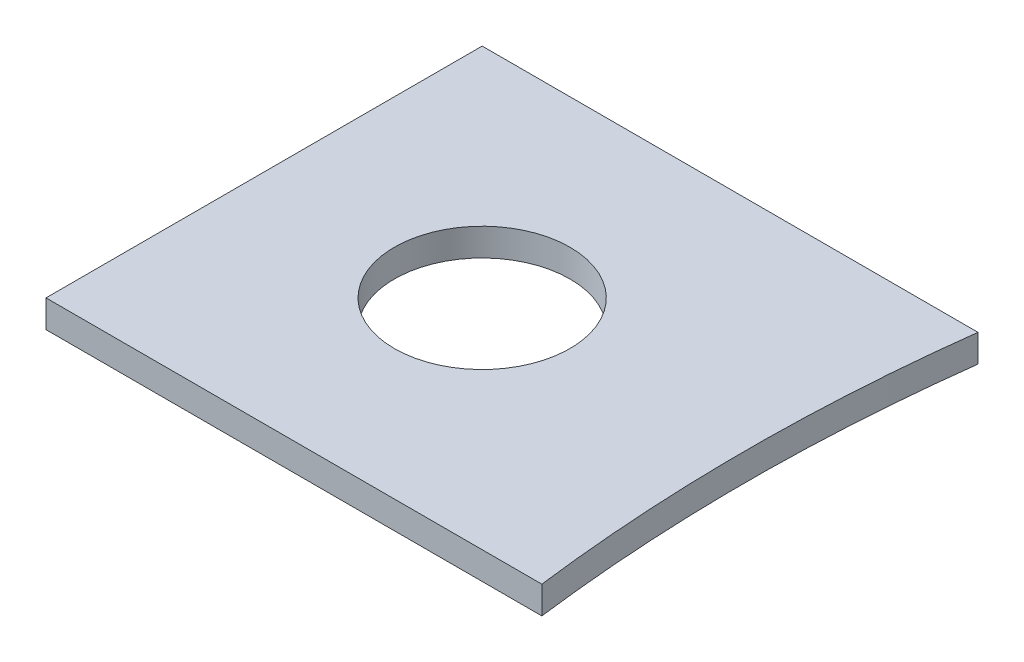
from build123d import *

# Parameters (mm, degrees)
SKIZZE1_R               = 38.25
LINEAR_AUSTRAGEN1_DEPTH = 12


with BuildPart() as part:
    # Skizze1 → Linear austragen1 (new body)
    with BuildSketch(Plane(origin=(0, 0, 0), x_dir=(1, 0, 0), z_dir=(0, 1, 0))):
        with BuildLine():
            Line((0, 0), (0, 190))
            Line((0, 190), (216, 190))
            ThreePointArc((216, 190), (209.99131011, 95), (216, 0))
            Line((216, 0), (0, 0))
        make_face()
        with Locations(Location((95, 95, 0), (0, 0, 270))):
            Circle(SKIZZE1_R, mode=Mode.SUBTRACT)
    extrude(amount=LINEAR_AUSTRAGEN1_DEPTH)


solid = part.part
